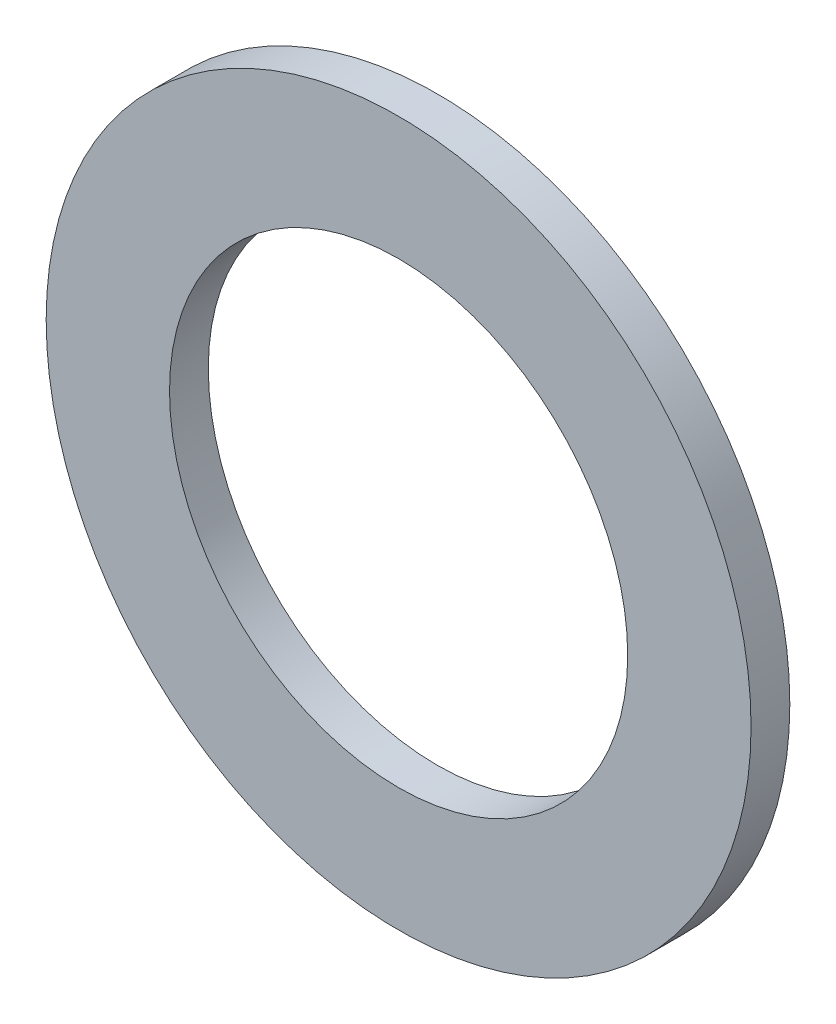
from build123d import *

# Parameters (mm, degrees)
ESQUISSE1_R          = 10
ESQUISSE1_R_2        = 6.5
BASE_EXTRUSION_DEPTH = 1.1


with BuildPart() as part:
    # Esquisse1 → Base-Extrusion (new body)
    with BuildSketch(Plane.XY):
        Circle(ESQUISSE1_R)
        Circle(ESQUISSE1_R_2, mode=Mode.SUBTRACT)
    extrude(amount=BASE_EXTRUSION_DEPTH)


solid = part.part
